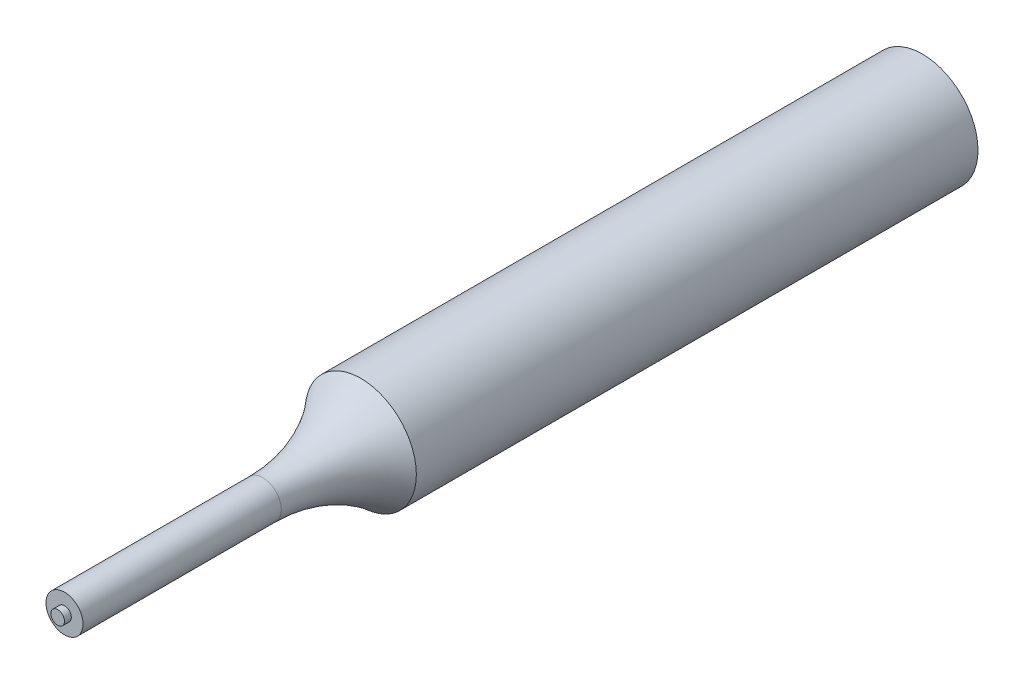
from build123d import *

# Parameters (mm, degrees)
LOGO3_BIB4_W = 0.5842
LOGO3_BIB4_H = 1.1684


with BuildPart() as part:
    # logo3_bib2 → Revolve2_Shoulder (revolve)
    with BuildSketch(Plane(origin=(0, 0, 0), x_dir=(1, 0, 0), z_dir=(0, 1, 0)), mode=Mode.PRIVATE) as revolve2_shoulder_sk:
        with BuildLine():
            Line((-4.7625, -6.35), (0, -6.35))
            Line((0, -6.35), (0, -79.8957))
            Line((0, -79.8957), (-1.5877032, -79.8957))
            Line((-1.5877032, -79.8957), (-1.5877032, -62.89573))
            ThreePointArc((-1.5877032, -62.89573), (-2.40788669, -58.405745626), (-4.7625, -54.4957))
            Line((-4.7625, -54.4957), (-4.7625, -6.35))
        make_face()
    revolve(revolve2_shoulder_sk.sketch.rotate(Axis((0, 0, 43.517168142), (0, 0, -1)), 180), axis=Axis((0, 0, 43.517168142), (0, 0, -1)))

    # logo3_bib4 → Revolve2_Shoulder_JT (revolve)
    with BuildSketch(Plane(origin=(0, 0, 0), x_dir=(1, 0, 0), z_dir=(0, 1, 0))):
        with Locations((-0.2921, -79.8957)):
            Rectangle(LOGO3_BIB4_W, LOGO3_BIB4_H)
    revolve(axis=Axis((0, 0, 0), (0, 0, 1)))

    # Sketch1_2 → Cut-Revolve_Ball_Shoulder (revolve, cut)
    with BuildSketch(Plane(origin=(0, 0, 0), x_dir=(1, 0, 0), z_dir=(0, 1, 0))):
        with BuildLine():
            Line((-12.410721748, -25.589774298), (-7.8105, -8.421513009))
            Line((-7.8105, -8.421513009), (-7.8105, -31.5849))
            ThreePointArc((-7.8105, -31.5849), (-11.588845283, -29.721626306), (-12.410721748, -25.589774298))
        make_face()
    revolve(axis=Axis((-7.8105, 0, 12.118432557), (0, 0, 1)), mode=Mode.SUBTRACT)


solid = part.part
